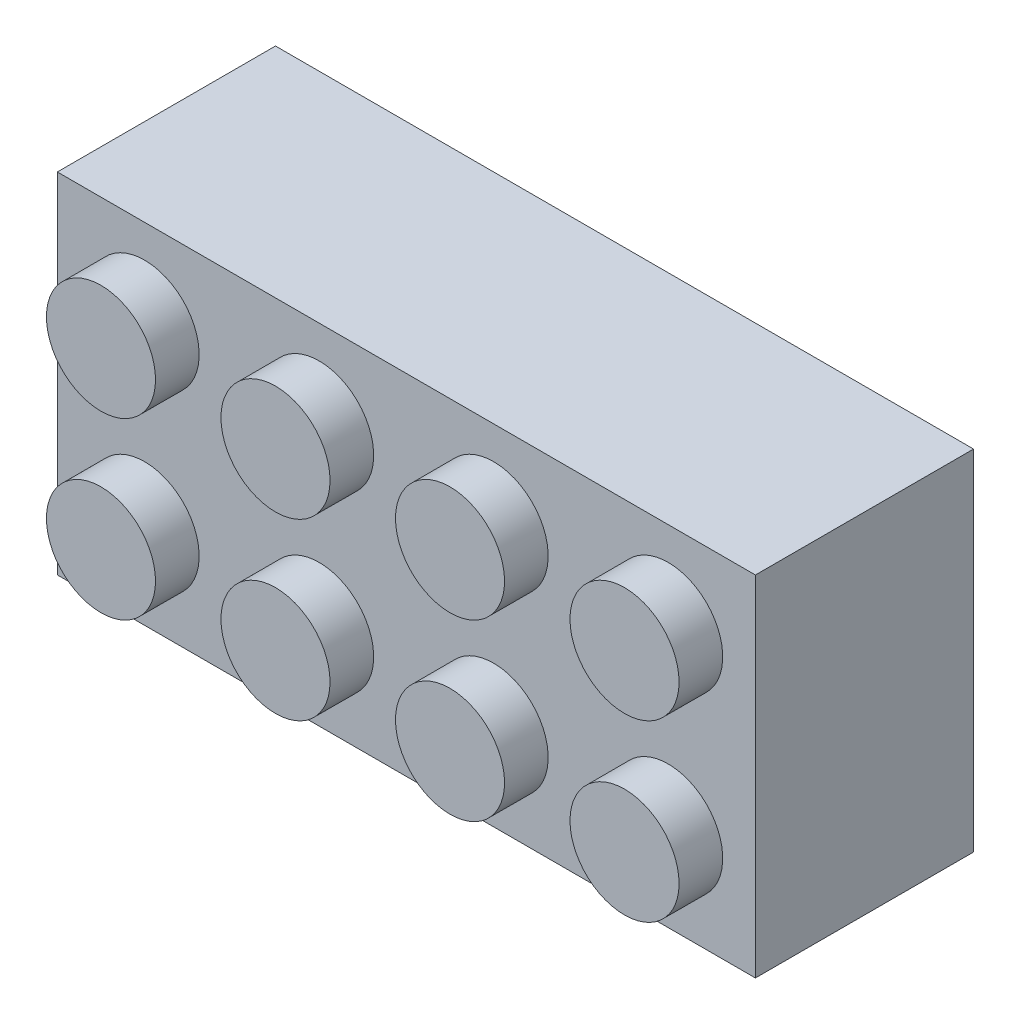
ISO-10303-21;
HEADER;
FILE_DESCRIPTION(('STEP AP214'),'2;1');
FILE_NAME('part.step','',(''),(''),'','','');
FILE_SCHEMA(('AUTOMOTIVE_DESIGN { 1 0 10303 214 1 1 1 1 }'));
ENDSEC;
DATA;
#1=APPLICATION_CONTEXT('core data for automotive mechanical design processes');
#2=APPLICATION_PROTOCOL_DEFINITION('international standard','automotive_design',2000,#1);
#3=PRODUCT_CONTEXT('',#1,'mechanical');
#4=PRODUCT('Part','Part','',(#3));
#5=PRODUCT_RELATED_PRODUCT_CATEGORY('part','',(#4));
#6=PRODUCT_DEFINITION_FORMATION('','',#4);
#7=PRODUCT_DEFINITION_CONTEXT('part definition',#1,'design');
#8=PRODUCT_DEFINITION('design','',#6,#7);
#9=PRODUCT_DEFINITION_SHAPE('','',#8);
#10=(LENGTH_UNIT() NAMED_UNIT(*) SI_UNIT(.MILLI.,.METRE.));
#11=(NAMED_UNIT(*) PLANE_ANGLE_UNIT() SI_UNIT($,.RADIAN.));
#12=(NAMED_UNIT(*) SI_UNIT($,.STERADIAN.) SOLID_ANGLE_UNIT());
#13=UNCERTAINTY_MEASURE_WITH_UNIT(LENGTH_MEASURE(1.E-05),#10,'distance_accuracy_value','');
#14=(GEOMETRIC_REPRESENTATION_CONTEXT(3) GLOBAL_UNCERTAINTY_ASSIGNED_CONTEXT((#13)) GLOBAL_UNIT_ASSIGNED_CONTEXT((#10,
#11,#12)) REPRESENTATION_CONTEXT('',''));
#15=CARTESIAN_POINT('',(0.,0.,0.));
#16=DIRECTION('',(0.,0.,1.));
#17=DIRECTION('',(1.,0.,0.));
#18=AXIS2_PLACEMENT_3D('',#15,#16,#17);
#19=CARTESIAN_POINT('',(0.,16.,9.));
#20=DIRECTION('',(0.,0.,-1.));
#21=DIRECTION('',(-1.,0.,0.));
#22=AXIS2_PLACEMENT_3D('',#19,#20,#21);
#23=PLANE('',#22);
#24=CARTESIAN_POINT('',(4.,12.,9.));
#25=DIRECTION('',(0.,0.,-1.));
#26=DIRECTION('',(-1.,0.,0.));
#27=AXIS2_PLACEMENT_3D('',#24,#25,#26);
#28=CIRCLE('',#27,1.5);
#29=CARTESIAN_POINT('',(2.5,12.,9.));
#30=VERTEX_POINT('',#29);
#31=EDGE_CURVE('E135',#30,#30,#28,.F.);
#32=ORIENTED_EDGE('',*,*,#31,.T.);
#33=EDGE_LOOP('',(#32));
#34=FACE_BOUND('',#33,.T.);
#35=DIRECTION('',(0.,-1.,0.));
#36=VECTOR('',#35,1.);
#37=CARTESIAN_POINT('',(1.,16.,9.));
#38=LINE('',#37,#36);
#39=CARTESIAN_POINT('',(1.,15.,9.));
#40=VERTEX_POINT('',#39);
#41=CARTESIAN_POINT('',(1.,1.,9.));
#42=VERTEX_POINT('',#41);
#43=EDGE_CURVE('E117',#40,#42,#38,.T.);
#44=ORIENTED_EDGE('',*,*,#43,.F.);
#45=DIRECTION('',(-1.,0.,0.));
#46=VECTOR('',#45,1.);
#47=CARTESIAN_POINT('',(0.,15.,9.));
#48=LINE('',#47,#46);
#49=CARTESIAN_POINT('',(31.,15.,9.));
#50=VERTEX_POINT('',#49);
#51=EDGE_CURVE('E125',#50,#40,#48,.T.);
#52=ORIENTED_EDGE('',*,*,#51,.F.);
#53=DIRECTION('',(0.,1.,0.));
#54=VECTOR('',#53,1.);
#55=CARTESIAN_POINT('',(31.,16.,9.));
#56=LINE('',#55,#54);
#57=CARTESIAN_POINT('',(31.,1.,9.));
#58=VERTEX_POINT('',#57);
#59=EDGE_CURVE('E116',#58,#50,#56,.T.);
#60=ORIENTED_EDGE('',*,*,#59,.F.);
#61=DIRECTION('',(1.,0.,0.));
#62=VECTOR('',#61,1.);
#63=CARTESIAN_POINT('',(0.,1.,9.));
#64=LINE('',#63,#62);
#65=EDGE_CURVE('E106',#42,#58,#64,.T.);
#66=ORIENTED_EDGE('',*,*,#65,.F.);
#67=EDGE_LOOP('',(#44,#52,#60,#66));
#68=FACE_BOUND('',#67,.T.);
#69=CARTESIAN_POINT('',(12.,12.,9.));
#70=DIRECTION('',(0.,0.,-1.));
#71=DIRECTION('',(-1.,0.,0.));
#72=AXIS2_PLACEMENT_3D('',#69,#70,#71);
#73=CIRCLE('',#72,1.5);
#74=CARTESIAN_POINT('',(10.5,12.,9.));
#75=VERTEX_POINT('',#74);
#76=EDGE_CURVE('E131',#75,#75,#73,.F.);
#77=ORIENTED_EDGE('',*,*,#76,.T.);
#78=EDGE_LOOP('',(#77));
#79=FACE_BOUND('',#78,.T.);
#80=CARTESIAN_POINT('',(20.,12.,9.));
#81=DIRECTION('',(0.,0.,-1.));
#82=DIRECTION('',(-1.,0.,0.));
#83=AXIS2_PLACEMENT_3D('',#80,#81,#82);
#84=CIRCLE('',#83,1.5);
#85=CARTESIAN_POINT('',(18.5,12.,9.));
#86=VERTEX_POINT('',#85);
#87=EDGE_CURVE('E134',#86,#86,#84,.F.);
#88=ORIENTED_EDGE('',*,*,#87,.T.);
#89=EDGE_LOOP('',(#88));
#90=FACE_BOUND('',#89,.T.);
#91=CARTESIAN_POINT('',(28.,12.,9.));
#92=DIRECTION('',(0.,0.,-1.));
#93=DIRECTION('',(-1.,0.,0.));
#94=AXIS2_PLACEMENT_3D('',#91,#92,#93);
#95=CIRCLE('',#94,1.5);
#96=CARTESIAN_POINT('',(26.5,12.,9.));
#97=VERTEX_POINT('',#96);
#98=EDGE_CURVE('E139',#97,#97,#95,.F.);
#99=ORIENTED_EDGE('',*,*,#98,.T.);
#100=EDGE_LOOP('',(#99));
#101=FACE_BOUND('',#100,.T.);
#102=CARTESIAN_POINT('',(4.,4.,9.));
#103=DIRECTION('',(0.,0.,-1.));
#104=DIRECTION('',(-1.,0.,0.));
#105=AXIS2_PLACEMENT_3D('',#102,#103,#104);
#106=CIRCLE('',#105,1.5);
#107=CARTESIAN_POINT('',(2.5,4.,9.));
#108=VERTEX_POINT('',#107);
#109=EDGE_CURVE('E143',#108,#108,#106,.F.);
#110=ORIENTED_EDGE('',*,*,#109,.T.);
#111=EDGE_LOOP('',(#110));
#112=FACE_BOUND('',#111,.T.);
#113=CARTESIAN_POINT('',(12.,4.,9.));
#114=DIRECTION('',(0.,0.,-1.));
#115=DIRECTION('',(-1.,0.,0.));
#116=AXIS2_PLACEMENT_3D('',#113,#114,#115);
#117=CIRCLE('',#116,1.5);
#118=CARTESIAN_POINT('',(10.5,4.,9.));
#119=VERTEX_POINT('',#118);
#120=EDGE_CURVE('E147',#119,#119,#117,.F.);
#121=ORIENTED_EDGE('',*,*,#120,.T.);
#122=EDGE_LOOP('',(#121));
#123=FACE_BOUND('',#122,.T.);
#124=CARTESIAN_POINT('',(20.,4.,9.));
#125=DIRECTION('',(0.,0.,-1.));
#126=DIRECTION('',(-1.,0.,0.));
#127=AXIS2_PLACEMENT_3D('',#124,#125,#126);
#128=CIRCLE('',#127,1.5);
#129=CARTESIAN_POINT('',(18.5,4.,9.));
#130=VERTEX_POINT('',#129);
#131=EDGE_CURVE('E151',#130,#130,#128,.F.);
#132=ORIENTED_EDGE('',*,*,#131,.T.);
#133=EDGE_LOOP('',(#132));
#134=FACE_BOUND('',#133,.T.);
#135=CARTESIAN_POINT('',(28.,4.,9.));
#136=DIRECTION('',(0.,0.,-1.));
#137=DIRECTION('',(-1.,0.,0.));
#138=AXIS2_PLACEMENT_3D('',#135,#136,#137);
#139=CIRCLE('',#138,1.5);
#140=CARTESIAN_POINT('',(26.5,4.,9.));
#141=VERTEX_POINT('',#140);
#142=EDGE_CURVE('E155',#141,#141,#139,.F.);
#143=ORIENTED_EDGE('',*,*,#142,.T.);
#144=EDGE_LOOP('',(#143));
#145=FACE_BOUND('',#144,.T.);
#146=CARTESIAN_POINT('',(8.,8.,9.));
#147=DIRECTION('',(0.,0.,-1.));
#148=DIRECTION('',(-1.,0.,0.));
#149=AXIS2_PLACEMENT_3D('',#146,#147,#148);
#150=CIRCLE('',#149,3.);
#151=CARTESIAN_POINT('',(5.,8.,9.));
#152=VERTEX_POINT('',#151);
#153=EDGE_CURVE('E307',#152,#152,#150,.T.);
#154=ORIENTED_EDGE('',*,*,#153,.F.);
#155=EDGE_LOOP('',(#154));
#156=FACE_BOUND('',#155,.T.);
#157=CARTESIAN_POINT('',(16.,8.,9.));
#158=DIRECTION('',(0.,0.,-1.));
#159=DIRECTION('',(-1.,0.,0.));
#160=AXIS2_PLACEMENT_3D('',#157,#158,#159);
#161=CIRCLE('',#160,3.);
#162=CARTESIAN_POINT('',(13.,8.,9.));
#163=VERTEX_POINT('',#162);
#164=EDGE_CURVE('E793',#163,#163,#161,.T.);
#165=ORIENTED_EDGE('',*,*,#164,.F.);
#166=EDGE_LOOP('',(#165));
#167=FACE_BOUND('',#166,.T.);
#168=CARTESIAN_POINT('',(24.,8.,9.));
#169=DIRECTION('',(0.,0.,-1.));
#170=DIRECTION('',(-1.,0.,0.));
#171=AXIS2_PLACEMENT_3D('',#168,#169,#170);
#172=CIRCLE('',#171,3.);
#173=CARTESIAN_POINT('',(21.,8.,9.));
#174=VERTEX_POINT('',#173);
#175=EDGE_CURVE('E782',#174,#174,#172,.T.);
#176=ORIENTED_EDGE('',*,*,#175,.F.);
#177=EDGE_LOOP('',(#176));
#178=FACE_BOUND('',#177,.T.);
#179=ADVANCED_FACE('F31',(#34,#68,#79,#90,#101,#112,#123,#134,#145,#156,#167,#178),#23,.T.);
#180=CARTESIAN_POINT('',(0.,16.,0.));
#181=DIRECTION('',(0.,0.,-1.));
#182=DIRECTION('',(-1.,0.,0.));
#183=AXIS2_PLACEMENT_3D('',#180,#181,#182);
#184=PLANE('',#183);
#185=DIRECTION('',(0.,-1.,0.));
#186=VECTOR('',#185,1.);
#187=CARTESIAN_POINT('',(0.,0.,0.));
#188=LINE('',#187,#186);
#189=CARTESIAN_POINT('',(0.,16.,0.));
#190=VERTEX_POINT('',#189);
#191=CARTESIAN_POINT('',(0.,0.,0.));
#192=VERTEX_POINT('',#191);
#193=EDGE_CURVE('E196',#190,#192,#188,.T.);
#194=ORIENTED_EDGE('',*,*,#193,.F.);
#195=DIRECTION('',(-1.,0.,0.));
#196=VECTOR('',#195,1.);
#197=CARTESIAN_POINT('',(0.,16.,0.));
#198=LINE('',#197,#196);
#199=CARTESIAN_POINT('',(32.,16.,0.));
#200=VERTEX_POINT('',#199);
#201=EDGE_CURVE('E76',#200,#190,#198,.T.);
#202=ORIENTED_EDGE('',*,*,#201,.F.);
#203=DIRECTION('',(0.,1.,0.));
#204=VECTOR('',#203,1.);
#205=CARTESIAN_POINT('',(32.,0.,0.));
#206=LINE('',#205,#204);
#207=CARTESIAN_POINT('',(32.,0.,0.));
#208=VERTEX_POINT('',#207);
#209=EDGE_CURVE('E208',#208,#200,#206,.T.);
#210=ORIENTED_EDGE('',*,*,#209,.F.);
#211=DIRECTION('',(1.,0.,0.));
#212=VECTOR('',#211,1.);
#213=CARTESIAN_POINT('',(0.,0.,0.));
#214=LINE('',#213,#212);
#215=EDGE_CURVE('E206',#192,#208,#214,.T.);
#216=ORIENTED_EDGE('',*,*,#215,.F.);
#217=EDGE_LOOP('',(#194,#202,#210,#216));
#218=FACE_BOUND('',#217,.T.);
#219=DIRECTION('',(-1.,0.,0.));
#220=VECTOR('',#219,1.);
#221=CARTESIAN_POINT('',(0.,15.,0.));
#222=LINE('',#221,#220);
#223=CARTESIAN_POINT('',(31.,15.,0.));
#224=VERTEX_POINT('',#223);
#225=CARTESIAN_POINT('',(1.,15.,0.));
#226=VERTEX_POINT('',#225);
#227=EDGE_CURVE('E186',#224,#226,#222,.T.);
#228=ORIENTED_EDGE('',*,*,#227,.T.);
#229=DIRECTION('',(0.,-1.,0.));
#230=VECTOR('',#229,1.);
#231=CARTESIAN_POINT('',(1.,16.,0.));
#232=LINE('',#231,#230);
#233=CARTESIAN_POINT('',(1.,1.,0.));
#234=VERTEX_POINT('',#233);
#235=EDGE_CURVE('E165',#226,#234,#232,.T.);
#236=ORIENTED_EDGE('',*,*,#235,.T.);
#237=DIRECTION('',(1.,0.,0.));
#238=VECTOR('',#237,1.);
#239=CARTESIAN_POINT('',(0.,1.,0.));
#240=LINE('',#239,#238);
#241=CARTESIAN_POINT('',(31.,1.,0.));
#242=VERTEX_POINT('',#241);
#243=EDGE_CURVE('E185',#234,#242,#240,.T.);
#244=ORIENTED_EDGE('',*,*,#243,.T.);
#245=DIRECTION('',(0.,1.,0.));
#246=VECTOR('',#245,1.);
#247=CARTESIAN_POINT('',(31.,16.,0.));
#248=LINE('',#247,#246);
#249=EDGE_CURVE('E46',#242,#224,#248,.T.);
#250=ORIENTED_EDGE('',*,*,#249,.T.);
#251=EDGE_LOOP('',(#228,#236,#244,#250));
#252=FACE_BOUND('',#251,.T.);
#253=ADVANCED_FACE('F294',(#218,#252),#184,.T.);
#254=CARTESIAN_POINT('',(0.,16.,10.));
#255=DIRECTION('',(0.,0.,-1.));
#256=DIRECTION('',(-1.,0.,0.));
#257=AXIS2_PLACEMENT_3D('',#254,#255,#256);
#258=PLANE('',#257);
#259=CARTESIAN_POINT('',(4.,12.,10.));
#260=DIRECTION('',(0.,0.,-1.));
#261=DIRECTION('',(-1.,0.,0.));
#262=AXIS2_PLACEMENT_3D('',#259,#260,#261);
#263=CIRCLE('',#262,2.5);
#264=CARTESIAN_POINT('',(1.5,12.,10.));
#265=VERTEX_POINT('',#264);
#266=EDGE_CURVE('E219',#265,#265,#263,.F.);
#267=ORIENTED_EDGE('',*,*,#266,.F.);
#268=EDGE_LOOP('',(#267));
#269=FACE_BOUND('',#268,.T.);
#270=DIRECTION('',(0.,-1.,0.));
#271=VECTOR('',#270,1.);
#272=CARTESIAN_POINT('',(0.,0.,10.));
#273=LINE('',#272,#271);
#274=CARTESIAN_POINT('',(0.,16.,10.));
#275=VERTEX_POINT('',#274);
#276=CARTESIAN_POINT('',(0.,0.,10.));
#277=VERTEX_POINT('',#276);
#278=EDGE_CURVE('E197',#275,#277,#273,.T.);
#279=ORIENTED_EDGE('',*,*,#278,.T.);
#280=DIRECTION('',(1.,0.,0.));
#281=VECTOR('',#280,1.);
#282=CARTESIAN_POINT('',(0.,0.,10.));
#283=LINE('',#282,#281);
#284=CARTESIAN_POINT('',(32.,0.,10.));
#285=VERTEX_POINT('',#284);
#286=EDGE_CURVE('E84',#277,#285,#283,.T.);
#287=ORIENTED_EDGE('',*,*,#286,.T.);
#288=DIRECTION('',(0.,1.,0.));
#289=VECTOR('',#288,1.);
#290=CARTESIAN_POINT('',(32.,0.,10.));
#291=LINE('',#290,#289);
#292=CARTESIAN_POINT('',(32.,16.,10.));
#293=VERTEX_POINT('',#292);
#294=EDGE_CURVE('E200',#285,#293,#291,.T.);
#295=ORIENTED_EDGE('',*,*,#294,.T.);
#296=DIRECTION('',(-1.,0.,0.));
#297=VECTOR('',#296,1.);
#298=CARTESIAN_POINT('',(0.,16.,10.));
#299=LINE('',#298,#297);
#300=EDGE_CURVE('E55',#293,#275,#299,.T.);
#301=ORIENTED_EDGE('',*,*,#300,.T.);
#302=EDGE_LOOP('',(#279,#287,#295,#301));
#303=FACE_BOUND('',#302,.T.);
#304=CARTESIAN_POINT('',(12.,12.,10.));
#305=DIRECTION('',(0.,0.,-1.));
#306=DIRECTION('',(-1.,0.,0.));
#307=AXIS2_PLACEMENT_3D('',#304,#305,#306);
#308=CIRCLE('',#307,2.5);
#309=CARTESIAN_POINT('',(9.5,12.,10.));
#310=VERTEX_POINT('',#309);
#311=EDGE_CURVE('E222',#310,#310,#308,.F.);
#312=ORIENTED_EDGE('',*,*,#311,.F.);
#313=EDGE_LOOP('',(#312));
#314=FACE_BOUND('',#313,.T.);
#315=CARTESIAN_POINT('',(20.,12.,10.));
#316=DIRECTION('',(0.,0.,-1.));
#317=DIRECTION('',(-1.,0.,0.));
#318=AXIS2_PLACEMENT_3D('',#315,#316,#317);
#319=CIRCLE('',#318,2.5);
#320=CARTESIAN_POINT('',(17.5,12.,10.));
#321=VERTEX_POINT('',#320);
#322=EDGE_CURVE('E225',#321,#321,#319,.F.);
#323=ORIENTED_EDGE('',*,*,#322,.F.);
#324=EDGE_LOOP('',(#323));
#325=FACE_BOUND('',#324,.T.);
#326=CARTESIAN_POINT('',(28.,12.,10.));
#327=DIRECTION('',(0.,0.,-1.));
#328=DIRECTION('',(-1.,0.,0.));
#329=AXIS2_PLACEMENT_3D('',#326,#327,#328);
#330=CIRCLE('',#329,2.5);
#331=CARTESIAN_POINT('',(25.5,12.,10.));
#332=VERTEX_POINT('',#331);
#333=EDGE_CURVE('E231',#332,#332,#330,.F.);
#334=ORIENTED_EDGE('',*,*,#333,.F.);
#335=EDGE_LOOP('',(#334));
#336=FACE_BOUND('',#335,.T.);
#337=CARTESIAN_POINT('',(4.,4.,10.));
#338=DIRECTION('',(0.,0.,-1.));
#339=DIRECTION('',(-1.,0.,0.));
#340=AXIS2_PLACEMENT_3D('',#337,#338,#339);
#341=CIRCLE('',#340,2.5);
#342=CARTESIAN_POINT('',(1.5,4.,10.));
#343=VERTEX_POINT('',#342);
#344=EDGE_CURVE('E237',#343,#343,#341,.F.);
#345=ORIENTED_EDGE('',*,*,#344,.F.);
#346=EDGE_LOOP('',(#345));
#347=FACE_BOUND('',#346,.T.);
#348=CARTESIAN_POINT('',(12.,4.,10.));
#349=DIRECTION('',(0.,0.,-1.));
#350=DIRECTION('',(-1.,0.,0.));
#351=AXIS2_PLACEMENT_3D('',#348,#349,#350);
#352=CIRCLE('',#351,2.5);
#353=CARTESIAN_POINT('',(9.5,4.,10.));
#354=VERTEX_POINT('',#353);
#355=EDGE_CURVE('E243',#354,#354,#352,.F.);
#356=ORIENTED_EDGE('',*,*,#355,.F.);
#357=EDGE_LOOP('',(#356));
#358=FACE_BOUND('',#357,.T.);
#359=CARTESIAN_POINT('',(20.,4.,10.));
#360=DIRECTION('',(0.,0.,-1.));
#361=DIRECTION('',(-1.,0.,0.));
#362=AXIS2_PLACEMENT_3D('',#359,#360,#361);
#363=CIRCLE('',#362,2.5);
#364=CARTESIAN_POINT('',(17.5,4.,10.));
#365=VERTEX_POINT('',#364);
#366=EDGE_CURVE('E249',#365,#365,#363,.F.);
#367=ORIENTED_EDGE('',*,*,#366,.F.);
#368=EDGE_LOOP('',(#367));
#369=FACE_BOUND('',#368,.T.);
#370=CARTESIAN_POINT('',(28.,4.,10.));
#371=DIRECTION('',(0.,0.,-1.));
#372=DIRECTION('',(-1.,0.,0.));
#373=AXIS2_PLACEMENT_3D('',#370,#371,#372);
#374=CIRCLE('',#373,2.5);
#375=CARTESIAN_POINT('',(25.5,4.,10.));
#376=VERTEX_POINT('',#375);
#377=EDGE_CURVE('E255',#376,#376,#374,.F.);
#378=ORIENTED_EDGE('',*,*,#377,.F.);
#379=EDGE_LOOP('',(#378));
#380=FACE_BOUND('',#379,.T.);
#381=ADVANCED_FACE('F299',(#269,#303,#314,#325,#336,#347,#358,#369,#380),#258,.F.);
#382=CARTESIAN_POINT('',(0.,0.,10.));
#383=DIRECTION('',(1.,0.,0.));
#384=DIRECTION('',(0.,0.,-1.));
#385=AXIS2_PLACEMENT_3D('',#382,#383,#384);
#386=PLANE('',#385);
#387=ORIENTED_EDGE('',*,*,#193,.T.);
#388=DIRECTION('',(0.,0.,-1.));
#389=VECTOR('',#388,1.);
#390=CARTESIAN_POINT('',(0.,0.,10.));
#391=LINE('',#390,#389);
#392=EDGE_CURVE('E217',#277,#192,#391,.T.);
#393=ORIENTED_EDGE('',*,*,#392,.F.);
#394=ORIENTED_EDGE('',*,*,#278,.F.);
#395=DIRECTION('',(0.,0.,-1.));
#396=VECTOR('',#395,1.);
#397=CARTESIAN_POINT('',(0.,16.,10.));
#398=LINE('',#397,#396);
#399=EDGE_CURVE('E203',#275,#190,#398,.T.);
#400=ORIENTED_EDGE('',*,*,#399,.T.);
#401=EDGE_LOOP('',(#387,#393,#394,#400));
#402=FACE_BOUND('',#401,.T.);
#403=ADVANCED_FACE('F409',(#402),#386,.F.);
#404=CARTESIAN_POINT('',(0.,0.,10.));
#405=DIRECTION('',(0.,1.,0.));
#406=DIRECTION('',(0.,0.,1.));
#407=AXIS2_PLACEMENT_3D('',#404,#405,#406);
#408=PLANE('',#407);
#409=ORIENTED_EDGE('',*,*,#215,.T.);
#410=DIRECTION('',(0.,0.,-1.));
#411=VECTOR('',#410,1.);
#412=CARTESIAN_POINT('',(32.,0.,10.));
#413=LINE('',#412,#411);
#414=EDGE_CURVE('E214',#285,#208,#413,.T.);
#415=ORIENTED_EDGE('',*,*,#414,.F.);
#416=ORIENTED_EDGE('',*,*,#286,.F.);
#417=ORIENTED_EDGE('',*,*,#392,.T.);
#418=EDGE_LOOP('',(#409,#415,#416,#417));
#419=FACE_BOUND('',#418,.T.);
#420=ADVANCED_FACE('F417',(#419),#408,.F.);
#421=CARTESIAN_POINT('',(32.,0.,10.));
#422=DIRECTION('',(-1.,0.,0.));
#423=DIRECTION('',(0.,0.,1.));
#424=AXIS2_PLACEMENT_3D('',#421,#422,#423);
#425=PLANE('',#424);
#426=ORIENTED_EDGE('',*,*,#209,.T.);
#427=DIRECTION('',(0.,0.,-1.));
#428=VECTOR('',#427,1.);
#429=CARTESIAN_POINT('',(32.,16.,10.));
#430=LINE('',#429,#428);
#431=EDGE_CURVE('E212',#293,#200,#430,.T.);
#432=ORIENTED_EDGE('',*,*,#431,.F.);
#433=ORIENTED_EDGE('',*,*,#294,.F.);
#434=ORIENTED_EDGE('',*,*,#414,.T.);
#435=EDGE_LOOP('',(#426,#432,#433,#434));
#436=FACE_BOUND('',#435,.T.);
#437=ADVANCED_FACE('F414',(#436),#425,.F.);
#438=CARTESIAN_POINT('',(0.,16.,10.));
#439=DIRECTION('',(0.,-1.,0.));
#440=DIRECTION('',(0.,0.,-1.));
#441=AXIS2_PLACEMENT_3D('',#438,#439,#440);
#442=PLANE('',#441);
#443=ORIENTED_EDGE('',*,*,#201,.T.);
#444=ORIENTED_EDGE('',*,*,#399,.F.);
#445=ORIENTED_EDGE('',*,*,#300,.F.);
#446=ORIENTED_EDGE('',*,*,#431,.T.);
#447=EDGE_LOOP('',(#443,#444,#445,#446));
#448=FACE_BOUND('',#447,.T.);
#449=ADVANCED_FACE('F406',(#448),#442,.F.);
#450=CARTESIAN_POINT('',(4.,12.,12.));
#451=DIRECTION('',(0.,0.,-1.));
#452=DIRECTION('',(-1.,0.,0.));
#453=AXIS2_PLACEMENT_3D('',#450,#451,#452);
#454=CYLINDRICAL_SURFACE('',#453,2.5);
#455=CARTESIAN_POINT('',(4.,12.,12.));
#456=DIRECTION('',(0.,0.,1.));
#457=DIRECTION('',(1.,0.,0.));
#458=AXIS2_PLACEMENT_3D('',#455,#456,#457);
#459=CIRCLE('',#458,2.5);
#460=CARTESIAN_POINT('',(6.5,12.,12.));
#461=VERTEX_POINT('',#460);
#462=EDGE_CURVE('E193',#461,#461,#459,.T.);
#463=ORIENTED_EDGE('',*,*,#462,.F.);
#464=EDGE_LOOP('',(#463));
#465=FACE_BOUND('',#464,.T.);
#466=ORIENTED_EDGE('',*,*,#266,.T.);
#467=EDGE_LOOP('',(#466));
#468=FACE_BOUND('',#467,.T.);
#469=ADVANCED_FACE('F402',(#465,#468),#454,.T.);
#470=CARTESIAN_POINT('',(4.,12.,12.));
#471=DIRECTION('',(0.,0.,1.));
#472=DIRECTION('',(1.,0.,0.));
#473=AXIS2_PLACEMENT_3D('',#470,#471,#472);
#474=PLANE('',#473);
#475=ORIENTED_EDGE('',*,*,#462,.T.);
#476=EDGE_LOOP('',(#475));
#477=FACE_BOUND('',#476,.T.);
#478=ADVANCED_FACE('F396',(#477),#474,.T.);
#479=CARTESIAN_POINT('',(12.,12.,12.));
#480=DIRECTION('',(0.,0.,-1.));
#481=DIRECTION('',(-1.,0.,0.));
#482=AXIS2_PLACEMENT_3D('',#479,#480,#481);
#483=CYLINDRICAL_SURFACE('',#482,2.5);
#484=CARTESIAN_POINT('',(12.,12.,12.));
#485=DIRECTION('',(0.,0.,1.));
#486=DIRECTION('',(1.,0.,0.));
#487=AXIS2_PLACEMENT_3D('',#484,#485,#486);
#488=CIRCLE('',#487,2.5);
#489=CARTESIAN_POINT('',(14.5,12.,12.));
#490=VERTEX_POINT('',#489);
#491=EDGE_CURVE('E182',#490,#490,#488,.T.);
#492=ORIENTED_EDGE('',*,*,#491,.F.);
#493=EDGE_LOOP('',(#492));
#494=FACE_BOUND('',#493,.T.);
#495=ORIENTED_EDGE('',*,*,#311,.T.);
#496=EDGE_LOOP('',(#495));
#497=FACE_BOUND('',#496,.T.);
#498=ADVANCED_FACE('F394',(#494,#497),#483,.T.);
#499=CARTESIAN_POINT('',(12.,12.,12.));
#500=DIRECTION('',(0.,0.,1.));
#501=DIRECTION('',(1.,0.,0.));
#502=AXIS2_PLACEMENT_3D('',#499,#500,#501);
#503=PLANE('',#502);
#504=ORIENTED_EDGE('',*,*,#491,.T.);
#505=EDGE_LOOP('',(#504));
#506=FACE_BOUND('',#505,.T.);
#507=ADVANCED_FACE('F390',(#506),#503,.T.);
#508=CARTESIAN_POINT('',(20.,12.,12.));
#509=DIRECTION('',(0.,0.,1.));
#510=DIRECTION('',(1.,0.,0.));
#511=AXIS2_PLACEMENT_3D('',#508,#509,#510);
#512=PLANE('',#511);
#513=CARTESIAN_POINT('',(20.,12.,12.));
#514=DIRECTION('',(0.,0.,1.));
#515=DIRECTION('',(1.,0.,0.));
#516=AXIS2_PLACEMENT_3D('',#513,#514,#515);
#517=CIRCLE('',#516,2.5);
#518=CARTESIAN_POINT('',(22.5,12.,12.));
#519=VERTEX_POINT('',#518);
#520=EDGE_CURVE('E228',#519,#519,#517,.T.);
#521=ORIENTED_EDGE('',*,*,#520,.T.);
#522=EDGE_LOOP('',(#521));
#523=FACE_BOUND('',#522,.T.);
#524=ADVANCED_FACE('F393',(#523),#512,.T.);
#525=CARTESIAN_POINT('',(20.,12.,12.));
#526=DIRECTION('',(0.,0.,-1.));
#527=DIRECTION('',(-1.,0.,0.));
#528=AXIS2_PLACEMENT_3D('',#525,#526,#527);
#529=CYLINDRICAL_SURFACE('',#528,2.5);
#530=ORIENTED_EDGE('',*,*,#520,.F.);
#531=EDGE_LOOP('',(#530));
#532=FACE_BOUND('',#531,.T.);
#533=ORIENTED_EDGE('',*,*,#322,.T.);
#534=EDGE_LOOP('',(#533));
#535=FACE_BOUND('',#534,.T.);
#536=ADVANCED_FACE('F424',(#532,#535),#529,.T.);
#537=CARTESIAN_POINT('',(28.,12.,12.));
#538=DIRECTION('',(0.,0.,1.));
#539=DIRECTION('',(1.,0.,0.));
#540=AXIS2_PLACEMENT_3D('',#537,#538,#539);
#541=PLANE('',#540);
#542=CARTESIAN_POINT('',(28.,12.,12.));
#543=DIRECTION('',(0.,0.,1.));
#544=DIRECTION('',(1.,0.,0.));
#545=AXIS2_PLACEMENT_3D('',#542,#543,#544);
#546=CIRCLE('',#545,2.5);
#547=CARTESIAN_POINT('',(30.5,12.,12.));
#548=VERTEX_POINT('',#547);
#549=EDGE_CURVE('E234',#548,#548,#546,.T.);
#550=ORIENTED_EDGE('',*,*,#549,.T.);
#551=EDGE_LOOP('',(#550));
#552=FACE_BOUND('',#551,.T.);
#553=ADVANCED_FACE('F427',(#552),#541,.T.);
#554=CARTESIAN_POINT('',(28.,12.,12.));
#555=DIRECTION('',(0.,0.,-1.));
#556=DIRECTION('',(-1.,0.,0.));
#557=AXIS2_PLACEMENT_3D('',#554,#555,#556);
#558=CYLINDRICAL_SURFACE('',#557,2.5);
#559=ORIENTED_EDGE('',*,*,#549,.F.);
#560=EDGE_LOOP('',(#559));
#561=FACE_BOUND('',#560,.T.);
#562=ORIENTED_EDGE('',*,*,#333,.T.);
#563=EDGE_LOOP('',(#562));
#564=FACE_BOUND('',#563,.T.);
#565=ADVANCED_FACE('F432',(#561,#564),#558,.T.);
#566=CARTESIAN_POINT('',(4.,4.,12.));
#567=DIRECTION('',(0.,0.,1.));
#568=DIRECTION('',(1.,0.,0.));
#569=AXIS2_PLACEMENT_3D('',#566,#567,#568);
#570=PLANE('',#569);
#571=CARTESIAN_POINT('',(4.,4.,12.));
#572=DIRECTION('',(0.,0.,1.));
#573=DIRECTION('',(1.,0.,0.));
#574=AXIS2_PLACEMENT_3D('',#571,#572,#573);
#575=CIRCLE('',#574,2.5);
#576=CARTESIAN_POINT('',(6.5,4.,12.));
#577=VERTEX_POINT('',#576);
#578=EDGE_CURVE('E240',#577,#577,#575,.T.);
#579=ORIENTED_EDGE('',*,*,#578,.T.);
#580=EDGE_LOOP('',(#579));
#581=FACE_BOUND('',#580,.T.);
#582=ADVANCED_FACE('F435',(#581),#570,.T.);
#583=CARTESIAN_POINT('',(4.,4.,12.));
#584=DIRECTION('',(0.,0.,-1.));
#585=DIRECTION('',(-1.,0.,0.));
#586=AXIS2_PLACEMENT_3D('',#583,#584,#585);
#587=CYLINDRICAL_SURFACE('',#586,2.5);
#588=ORIENTED_EDGE('',*,*,#578,.F.);
#589=EDGE_LOOP('',(#588));
#590=FACE_BOUND('',#589,.T.);
#591=ORIENTED_EDGE('',*,*,#344,.T.);
#592=EDGE_LOOP('',(#591));
#593=FACE_BOUND('',#592,.T.);
#594=ADVANCED_FACE('F440',(#590,#593),#587,.T.);
#595=CARTESIAN_POINT('',(12.,4.,12.));
#596=DIRECTION('',(0.,0.,1.));
#597=DIRECTION('',(1.,0.,0.));
#598=AXIS2_PLACEMENT_3D('',#595,#596,#597);
#599=PLANE('',#598);
#600=CARTESIAN_POINT('',(12.,4.,12.));
#601=DIRECTION('',(0.,0.,1.));
#602=DIRECTION('',(1.,0.,0.));
#603=AXIS2_PLACEMENT_3D('',#600,#601,#602);
#604=CIRCLE('',#603,2.5);
#605=CARTESIAN_POINT('',(14.5,4.,12.));
#606=VERTEX_POINT('',#605);
#607=EDGE_CURVE('E246',#606,#606,#604,.T.);
#608=ORIENTED_EDGE('',*,*,#607,.T.);
#609=EDGE_LOOP('',(#608));
#610=FACE_BOUND('',#609,.T.);
#611=ADVANCED_FACE('F443',(#610),#599,.T.);
#612=CARTESIAN_POINT('',(12.,4.,12.));
#613=DIRECTION('',(0.,0.,-1.));
#614=DIRECTION('',(-1.,0.,0.));
#615=AXIS2_PLACEMENT_3D('',#612,#613,#614);
#616=CYLINDRICAL_SURFACE('',#615,2.5);
#617=ORIENTED_EDGE('',*,*,#607,.F.);
#618=EDGE_LOOP('',(#617));
#619=FACE_BOUND('',#618,.T.);
#620=ORIENTED_EDGE('',*,*,#355,.T.);
#621=EDGE_LOOP('',(#620));
#622=FACE_BOUND('',#621,.T.);
#623=ADVANCED_FACE('F448',(#619,#622),#616,.T.);
#624=CARTESIAN_POINT('',(20.,4.,12.));
#625=DIRECTION('',(0.,0.,1.));
#626=DIRECTION('',(1.,0.,0.));
#627=AXIS2_PLACEMENT_3D('',#624,#625,#626);
#628=PLANE('',#627);
#629=CARTESIAN_POINT('',(20.,4.,12.));
#630=DIRECTION('',(0.,0.,1.));
#631=DIRECTION('',(1.,0.,0.));
#632=AXIS2_PLACEMENT_3D('',#629,#630,#631);
#633=CIRCLE('',#632,2.5);
#634=CARTESIAN_POINT('',(22.5,4.,12.));
#635=VERTEX_POINT('',#634);
#636=EDGE_CURVE('E252',#635,#635,#633,.T.);
#637=ORIENTED_EDGE('',*,*,#636,.T.);
#638=EDGE_LOOP('',(#637));
#639=FACE_BOUND('',#638,.T.);
#640=ADVANCED_FACE('F451',(#639),#628,.T.);
#641=CARTESIAN_POINT('',(20.,4.,12.));
#642=DIRECTION('',(0.,0.,-1.));
#643=DIRECTION('',(-1.,0.,0.));
#644=AXIS2_PLACEMENT_3D('',#641,#642,#643);
#645=CYLINDRICAL_SURFACE('',#644,2.5);
#646=ORIENTED_EDGE('',*,*,#636,.F.);
#647=EDGE_LOOP('',(#646));
#648=FACE_BOUND('',#647,.T.);
#649=ORIENTED_EDGE('',*,*,#366,.T.);
#650=EDGE_LOOP('',(#649));
#651=FACE_BOUND('',#650,.T.);
#652=ADVANCED_FACE('F456',(#648,#651),#645,.T.);
#653=CARTESIAN_POINT('',(28.,4.,12.));
#654=DIRECTION('',(0.,0.,1.));
#655=DIRECTION('',(1.,0.,0.));
#656=AXIS2_PLACEMENT_3D('',#653,#654,#655);
#657=PLANE('',#656);
#658=CARTESIAN_POINT('',(28.,4.,12.));
#659=DIRECTION('',(0.,0.,1.));
#660=DIRECTION('',(1.,0.,0.));
#661=AXIS2_PLACEMENT_3D('',#658,#659,#660);
#662=CIRCLE('',#661,2.5);
#663=CARTESIAN_POINT('',(30.5,4.,12.));
#664=VERTEX_POINT('',#663);
#665=EDGE_CURVE('E258',#664,#664,#662,.T.);
#666=ORIENTED_EDGE('',*,*,#665,.T.);
#667=EDGE_LOOP('',(#666));
#668=FACE_BOUND('',#667,.T.);
#669=ADVANCED_FACE('F33',(#668),#657,.T.);
#670=CARTESIAN_POINT('',(28.,4.,12.));
#671=DIRECTION('',(0.,0.,-1.));
#672=DIRECTION('',(-1.,0.,0.));
#673=AXIS2_PLACEMENT_3D('',#670,#671,#672);
#674=CYLINDRICAL_SURFACE('',#673,2.5);
#675=ORIENTED_EDGE('',*,*,#665,.F.);
#676=EDGE_LOOP('',(#675));
#677=FACE_BOUND('',#676,.T.);
#678=ORIENTED_EDGE('',*,*,#377,.T.);
#679=EDGE_LOOP('',(#678));
#680=FACE_BOUND('',#679,.T.);
#681=ADVANCED_FACE('F462',(#677,#680),#674,.T.);
#682=CARTESIAN_POINT('',(1.,0.,10.));
#683=DIRECTION('',(1.,0.,0.));
#684=DIRECTION('',(0.,0.,-1.));
#685=AXIS2_PLACEMENT_3D('',#682,#683,#684);
#686=PLANE('',#685);
#687=ORIENTED_EDGE('',*,*,#235,.F.);
#688=DIRECTION('',(0.,0.,-1.));
#689=VECTOR('',#688,1.);
#690=CARTESIAN_POINT('',(1.,15.,10.));
#691=LINE('',#690,#689);
#692=EDGE_CURVE('E127',#40,#226,#691,.T.);
#693=ORIENTED_EDGE('',*,*,#692,.F.);
#694=ORIENTED_EDGE('',*,*,#43,.T.);
#695=DIRECTION('',(0.,0.,-1.));
#696=VECTOR('',#695,1.);
#697=CARTESIAN_POINT('',(1.,1.,10.));
#698=LINE('',#697,#696);
#699=EDGE_CURVE('E111',#42,#234,#698,.T.);
#700=ORIENTED_EDGE('',*,*,#699,.T.);
#701=EDGE_LOOP('',(#687,#693,#694,#700));
#702=FACE_BOUND('',#701,.T.);
#703=ADVANCED_FACE('F312',(#702),#686,.T.);
#704=CARTESIAN_POINT('',(0.,1.,10.));
#705=DIRECTION('',(0.,1.,0.));
#706=DIRECTION('',(0.,0.,1.));
#707=AXIS2_PLACEMENT_3D('',#704,#705,#706);
#708=PLANE('',#707);
#709=ORIENTED_EDGE('',*,*,#243,.F.);
#710=ORIENTED_EDGE('',*,*,#699,.F.);
#711=ORIENTED_EDGE('',*,*,#65,.T.);
#712=DIRECTION('',(0.,0.,-1.));
#713=VECTOR('',#712,1.);
#714=CARTESIAN_POINT('',(31.,1.,10.));
#715=LINE('',#714,#713);
#716=EDGE_CURVE('E108',#58,#242,#715,.T.);
#717=ORIENTED_EDGE('',*,*,#716,.T.);
#718=EDGE_LOOP('',(#709,#710,#711,#717));
#719=FACE_BOUND('',#718,.T.);
#720=ADVANCED_FACE('F107',(#719),#708,.T.);
#721=CARTESIAN_POINT('',(31.,0.,10.));
#722=DIRECTION('',(-1.,0.,0.));
#723=DIRECTION('',(0.,0.,1.));
#724=AXIS2_PLACEMENT_3D('',#721,#722,#723);
#725=PLANE('',#724);
#726=ORIENTED_EDGE('',*,*,#249,.F.);
#727=ORIENTED_EDGE('',*,*,#716,.F.);
#728=ORIENTED_EDGE('',*,*,#59,.T.);
#729=DIRECTION('',(0.,0.,-1.));
#730=VECTOR('',#729,1.);
#731=CARTESIAN_POINT('',(31.,15.,10.));
#732=LINE('',#731,#730);
#733=EDGE_CURVE('E121',#50,#224,#732,.T.);
#734=ORIENTED_EDGE('',*,*,#733,.T.);
#735=EDGE_LOOP('',(#726,#727,#728,#734));
#736=FACE_BOUND('',#735,.T.);
#737=ADVANCED_FACE('F119',(#736),#725,.T.);
#738=CARTESIAN_POINT('',(0.,15.,10.));
#739=DIRECTION('',(0.,-1.,0.));
#740=DIRECTION('',(0.,0.,-1.));
#741=AXIS2_PLACEMENT_3D('',#738,#739,#740);
#742=PLANE('',#741);
#743=ORIENTED_EDGE('',*,*,#227,.F.);
#744=ORIENTED_EDGE('',*,*,#733,.F.);
#745=ORIENTED_EDGE('',*,*,#51,.T.);
#746=ORIENTED_EDGE('',*,*,#692,.T.);
#747=EDGE_LOOP('',(#743,#744,#745,#746));
#748=FACE_BOUND('',#747,.T.);
#749=ADVANCED_FACE('F315',(#748),#742,.T.);
#750=CARTESIAN_POINT('',(4.,12.,12.));
#751=DIRECTION('',(0.,0.,-1.));
#752=DIRECTION('',(-1.,0.,0.));
#753=AXIS2_PLACEMENT_3D('',#750,#751,#752);
#754=CYLINDRICAL_SURFACE('',#753,1.5);
#755=CARTESIAN_POINT('',(4.,12.,11.));
#756=DIRECTION('',(0.,0.,1.));
#757=DIRECTION('',(1.,0.,0.));
#758=AXIS2_PLACEMENT_3D('',#755,#756,#757);
#759=CIRCLE('',#758,1.5);
#760=CARTESIAN_POINT('',(5.5,12.,11.));
#761=VERTEX_POINT('',#760);
#762=EDGE_CURVE('E162',#761,#761,#759,.T.);
#763=ORIENTED_EDGE('',*,*,#762,.T.);
#764=EDGE_LOOP('',(#763));
#765=FACE_BOUND('',#764,.T.);
#766=ORIENTED_EDGE('',*,*,#31,.F.);
#767=EDGE_LOOP('',(#766));
#768=FACE_BOUND('',#767,.T.);
#769=ADVANCED_FACE('F318',(#765,#768),#754,.F.);
#770=CARTESIAN_POINT('',(4.,12.,11.));
#771=DIRECTION('',(0.,0.,1.));
#772=DIRECTION('',(1.,0.,0.));
#773=AXIS2_PLACEMENT_3D('',#770,#771,#772);
#774=PLANE('',#773);
#775=ORIENTED_EDGE('',*,*,#762,.F.);
#776=EDGE_LOOP('',(#775));
#777=FACE_BOUND('',#776,.T.);
#778=ADVANCED_FACE('F324',(#777),#774,.F.);
#779=CARTESIAN_POINT('',(12.,12.,12.));
#780=DIRECTION('',(0.,0.,-1.));
#781=DIRECTION('',(-1.,0.,0.));
#782=AXIS2_PLACEMENT_3D('',#779,#780,#781);
#783=CYLINDRICAL_SURFACE('',#782,1.5);
#784=CARTESIAN_POINT('',(12.,12.,11.));
#785=DIRECTION('',(0.,0.,1.));
#786=DIRECTION('',(1.,0.,0.));
#787=AXIS2_PLACEMENT_3D('',#784,#785,#786);
#788=CIRCLE('',#787,1.5);
#789=CARTESIAN_POINT('',(13.5,12.,11.));
#790=VERTEX_POINT('',#789);
#791=EDGE_CURVE('E166',#790,#790,#788,.T.);
#792=ORIENTED_EDGE('',*,*,#791,.T.);
#793=EDGE_LOOP('',(#792));
#794=FACE_BOUND('',#793,.T.);
#795=ORIENTED_EDGE('',*,*,#76,.F.);
#796=EDGE_LOOP('',(#795));
#797=FACE_BOUND('',#796,.T.);
#798=ADVANCED_FACE('F332',(#794,#797),#783,.F.);
#799=CARTESIAN_POINT('',(12.,12.,11.));
#800=DIRECTION('',(0.,0.,1.));
#801=DIRECTION('',(1.,0.,0.));
#802=AXIS2_PLACEMENT_3D('',#799,#800,#801);
#803=PLANE('',#802);
#804=ORIENTED_EDGE('',*,*,#791,.F.);
#805=EDGE_LOOP('',(#804));
#806=FACE_BOUND('',#805,.T.);
#807=ADVANCED_FACE('F334',(#806),#803,.F.);
#808=CARTESIAN_POINT('',(20.,12.,11.));
#809=DIRECTION('',(0.,0.,1.));
#810=DIRECTION('',(1.,0.,0.));
#811=AXIS2_PLACEMENT_3D('',#808,#809,#810);
#812=PLANE('',#811);
#813=CARTESIAN_POINT('',(20.,12.,11.));
#814=DIRECTION('',(0.,0.,1.));
#815=DIRECTION('',(1.,0.,0.));
#816=AXIS2_PLACEMENT_3D('',#813,#814,#815);
#817=CIRCLE('',#816,1.5);
#818=CARTESIAN_POINT('',(21.5,12.,11.));
#819=VERTEX_POINT('',#818);
#820=EDGE_CURVE('E138',#819,#819,#817,.T.);
#821=ORIENTED_EDGE('',*,*,#820,.F.);
#822=EDGE_LOOP('',(#821));
#823=FACE_BOUND('',#822,.T.);
#824=ADVANCED_FACE('F338',(#823),#812,.F.);
#825=CARTESIAN_POINT('',(20.,12.,12.));
#826=DIRECTION('',(0.,0.,-1.));
#827=DIRECTION('',(-1.,0.,0.));
#828=AXIS2_PLACEMENT_3D('',#825,#826,#827);
#829=CYLINDRICAL_SURFACE('',#828,1.5);
#830=ORIENTED_EDGE('',*,*,#820,.T.);
#831=EDGE_LOOP('',(#830));
#832=FACE_BOUND('',#831,.T.);
#833=ORIENTED_EDGE('',*,*,#87,.F.);
#834=EDGE_LOOP('',(#833));
#835=FACE_BOUND('',#834,.T.);
#836=ADVANCED_FACE('F344',(#832,#835),#829,.F.);
#837=CARTESIAN_POINT('',(28.,12.,11.));
#838=DIRECTION('',(0.,0.,1.));
#839=DIRECTION('',(1.,0.,0.));
#840=AXIS2_PLACEMENT_3D('',#837,#838,#839);
#841=PLANE('',#840);
#842=CARTESIAN_POINT('',(28.,12.,11.));
#843=DIRECTION('',(0.,0.,1.));
#844=DIRECTION('',(1.,0.,0.));
#845=AXIS2_PLACEMENT_3D('',#842,#843,#844);
#846=CIRCLE('',#845,1.5);
#847=CARTESIAN_POINT('',(29.5,12.,11.));
#848=VERTEX_POINT('',#847);
#849=EDGE_CURVE('E142',#848,#848,#846,.T.);
#850=ORIENTED_EDGE('',*,*,#849,.F.);
#851=EDGE_LOOP('',(#850));
#852=FACE_BOUND('',#851,.T.);
#853=ADVANCED_FACE('F348',(#852),#841,.F.);
#854=CARTESIAN_POINT('',(28.,12.,12.));
#855=DIRECTION('',(0.,0.,-1.));
#856=DIRECTION('',(-1.,0.,0.));
#857=AXIS2_PLACEMENT_3D('',#854,#855,#856);
#858=CYLINDRICAL_SURFACE('',#857,1.5);
#859=ORIENTED_EDGE('',*,*,#849,.T.);
#860=EDGE_LOOP('',(#859));
#861=FACE_BOUND('',#860,.T.);
#862=ORIENTED_EDGE('',*,*,#98,.F.);
#863=EDGE_LOOP('',(#862));
#864=FACE_BOUND('',#863,.T.);
#865=ADVANCED_FACE('F352',(#861,#864),#858,.F.);
#866=CARTESIAN_POINT('',(4.,4.,11.));
#867=DIRECTION('',(0.,0.,1.));
#868=DIRECTION('',(1.,0.,0.));
#869=AXIS2_PLACEMENT_3D('',#866,#867,#868);
#870=PLANE('',#869);
#871=CARTESIAN_POINT('',(4.,4.,11.));
#872=DIRECTION('',(0.,0.,1.));
#873=DIRECTION('',(1.,0.,0.));
#874=AXIS2_PLACEMENT_3D('',#871,#872,#873);
#875=CIRCLE('',#874,1.5);
#876=CARTESIAN_POINT('',(5.5,4.,11.));
#877=VERTEX_POINT('',#876);
#878=EDGE_CURVE('E146',#877,#877,#875,.T.);
#879=ORIENTED_EDGE('',*,*,#878,.F.);
#880=EDGE_LOOP('',(#879));
#881=FACE_BOUND('',#880,.T.);
#882=ADVANCED_FACE('F356',(#881),#870,.F.);
#883=CARTESIAN_POINT('',(4.,4.,12.));
#884=DIRECTION('',(0.,0.,-1.));
#885=DIRECTION('',(-1.,0.,0.));
#886=AXIS2_PLACEMENT_3D('',#883,#884,#885);
#887=CYLINDRICAL_SURFACE('',#886,1.5);
#888=ORIENTED_EDGE('',*,*,#878,.T.);
#889=EDGE_LOOP('',(#888));
#890=FACE_BOUND('',#889,.T.);
#891=ORIENTED_EDGE('',*,*,#109,.F.);
#892=EDGE_LOOP('',(#891));
#893=FACE_BOUND('',#892,.T.);
#894=ADVANCED_FACE('F360',(#890,#893),#887,.F.);
#895=CARTESIAN_POINT('',(12.,4.,11.));
#896=DIRECTION('',(0.,0.,1.));
#897=DIRECTION('',(1.,0.,0.));
#898=AXIS2_PLACEMENT_3D('',#895,#896,#897);
#899=PLANE('',#898);
#900=CARTESIAN_POINT('',(12.,4.,11.));
#901=DIRECTION('',(0.,0.,1.));
#902=DIRECTION('',(1.,0.,0.));
#903=AXIS2_PLACEMENT_3D('',#900,#901,#902);
#904=CIRCLE('',#903,1.5);
#905=CARTESIAN_POINT('',(13.5,4.,11.));
#906=VERTEX_POINT('',#905);
#907=EDGE_CURVE('E150',#906,#906,#904,.T.);
#908=ORIENTED_EDGE('',*,*,#907,.F.);
#909=EDGE_LOOP('',(#908));
#910=FACE_BOUND('',#909,.T.);
#911=ADVANCED_FACE('F364',(#910),#899,.F.);
#912=CARTESIAN_POINT('',(12.,4.,12.));
#913=DIRECTION('',(0.,0.,-1.));
#914=DIRECTION('',(-1.,0.,0.));
#915=AXIS2_PLACEMENT_3D('',#912,#913,#914);
#916=CYLINDRICAL_SURFACE('',#915,1.5);
#917=ORIENTED_EDGE('',*,*,#907,.T.);
#918=EDGE_LOOP('',(#917));
#919=FACE_BOUND('',#918,.T.);
#920=ORIENTED_EDGE('',*,*,#120,.F.);
#921=EDGE_LOOP('',(#920));
#922=FACE_BOUND('',#921,.T.);
#923=ADVANCED_FACE('F368',(#919,#922),#916,.F.);
#924=CARTESIAN_POINT('',(20.,4.,11.));
#925=DIRECTION('',(0.,0.,1.));
#926=DIRECTION('',(1.,0.,0.));
#927=AXIS2_PLACEMENT_3D('',#924,#925,#926);
#928=PLANE('',#927);
#929=CARTESIAN_POINT('',(20.,4.,11.));
#930=DIRECTION('',(0.,0.,1.));
#931=DIRECTION('',(1.,0.,0.));
#932=AXIS2_PLACEMENT_3D('',#929,#930,#931);
#933=CIRCLE('',#932,1.5);
#934=CARTESIAN_POINT('',(21.5,4.,11.));
#935=VERTEX_POINT('',#934);
#936=EDGE_CURVE('E154',#935,#935,#933,.T.);
#937=ORIENTED_EDGE('',*,*,#936,.F.);
#938=EDGE_LOOP('',(#937));
#939=FACE_BOUND('',#938,.T.);
#940=ADVANCED_FACE('F372',(#939),#928,.F.);
#941=CARTESIAN_POINT('',(20.,4.,12.));
#942=DIRECTION('',(0.,0.,-1.));
#943=DIRECTION('',(-1.,0.,0.));
#944=AXIS2_PLACEMENT_3D('',#941,#942,#943);
#945=CYLINDRICAL_SURFACE('',#944,1.5);
#946=ORIENTED_EDGE('',*,*,#936,.T.);
#947=EDGE_LOOP('',(#946));
#948=FACE_BOUND('',#947,.T.);
#949=ORIENTED_EDGE('',*,*,#131,.F.);
#950=EDGE_LOOP('',(#949));
#951=FACE_BOUND('',#950,.T.);
#952=ADVANCED_FACE('F376',(#948,#951),#945,.F.);
#953=CARTESIAN_POINT('',(28.,4.,11.));
#954=DIRECTION('',(0.,0.,1.));
#955=DIRECTION('',(1.,0.,0.));
#956=AXIS2_PLACEMENT_3D('',#953,#954,#955);
#957=PLANE('',#956);
#958=CARTESIAN_POINT('',(28.,4.,11.));
#959=DIRECTION('',(0.,0.,1.));
#960=DIRECTION('',(1.,0.,0.));
#961=AXIS2_PLACEMENT_3D('',#958,#959,#960);
#962=CIRCLE('',#961,1.5);
#963=CARTESIAN_POINT('',(29.5,4.,11.));
#964=VERTEX_POINT('',#963);
#965=EDGE_CURVE('E158',#964,#964,#962,.T.);
#966=ORIENTED_EDGE('',*,*,#965,.F.);
#967=EDGE_LOOP('',(#966));
#968=FACE_BOUND('',#967,.T.);
#969=ADVANCED_FACE('F380',(#968),#957,.F.);
#970=CARTESIAN_POINT('',(28.,4.,12.));
#971=DIRECTION('',(0.,0.,-1.));
#972=DIRECTION('',(-1.,0.,0.));
#973=AXIS2_PLACEMENT_3D('',#970,#971,#972);
#974=CYLINDRICAL_SURFACE('',#973,1.5);
#975=ORIENTED_EDGE('',*,*,#965,.T.);
#976=EDGE_LOOP('',(#975));
#977=FACE_BOUND('',#976,.T.);
#978=ORIENTED_EDGE('',*,*,#142,.F.);
#979=EDGE_LOOP('',(#978));
#980=FACE_BOUND('',#979,.T.);
#981=ADVANCED_FACE('F384',(#977,#980),#974,.F.);
#982=CARTESIAN_POINT('',(8.,8.,0.));
#983=DIRECTION('',(0.,0.,-1.));
#984=DIRECTION('',(-1.,0.,0.));
#985=AXIS2_PLACEMENT_3D('',#982,#983,#984);
#986=PLANE('',#985);
#987=CARTESIAN_POINT('',(8.,8.,0.));
#988=DIRECTION('',(0.,0.,-1.));
#989=DIRECTION('',(-1.,0.,0.));
#990=AXIS2_PLACEMENT_3D('',#987,#988,#989);
#991=CIRCLE('',#990,3.);
#992=CARTESIAN_POINT('',(5.,8.,0.));
#993=VERTEX_POINT('',#992);
#994=EDGE_CURVE('E169',#993,#993,#991,.T.);
#995=ORIENTED_EDGE('',*,*,#994,.T.);
#996=EDGE_LOOP('',(#995));
#997=FACE_BOUND('',#996,.T.);
#998=CARTESIAN_POINT('',(8.,8.,0.));
#999=DIRECTION('',(0.,0.,-1.));
#1000=DIRECTION('',(-1.,0.,0.));
#1001=AXIS2_PLACEMENT_3D('',#998,#999,#1000);
#1002=CIRCLE('',#1001,2.5);
#1003=CARTESIAN_POINT('',(5.5,8.,0.));
#1004=VERTEX_POINT('',#1003);
#1005=EDGE_CURVE('E797',#1004,#1004,#1002,.T.);
#1006=ORIENTED_EDGE('',*,*,#1005,.F.);
#1007=EDGE_LOOP('',(#1006));
#1008=FACE_BOUND('',#1007,.T.);
#1009=ADVANCED_FACE('F388',(#997,#1008),#986,.T.);
#1010=CARTESIAN_POINT('',(8.,8.,0.));
#1011=DIRECTION('',(0.,0.,1.));
#1012=DIRECTION('',(1.,0.,0.));
#1013=AXIS2_PLACEMENT_3D('',#1010,#1011,#1012);
#1014=CYLINDRICAL_SURFACE('',#1013,3.);
#1015=ORIENTED_EDGE('',*,*,#994,.F.);
#1016=EDGE_LOOP('',(#1015));
#1017=FACE_BOUND('',#1016,.T.);
#1018=ORIENTED_EDGE('',*,*,#153,.T.);
#1019=EDGE_LOOP('',(#1018));
#1020=FACE_BOUND('',#1019,.T.);
#1021=ADVANCED_FACE('F688',(#1017,#1020),#1014,.T.);
#1022=CARTESIAN_POINT('',(8.,8.,0.));
#1023=DIRECTION('',(0.,0.,1.));
#1024=DIRECTION('',(1.,0.,0.));
#1025=AXIS2_PLACEMENT_3D('',#1022,#1023,#1024);
#1026=CYLINDRICAL_SURFACE('',#1025,2.5);
#1027=ORIENTED_EDGE('',*,*,#1005,.T.);
#1028=EDGE_LOOP('',(#1027));
#1029=FACE_BOUND('',#1028,.T.);
#1030=CARTESIAN_POINT('',(8.,8.,9.));
#1031=DIRECTION('',(0.,0.,-1.));
#1032=DIRECTION('',(-1.,0.,0.));
#1033=AXIS2_PLACEMENT_3D('',#1030,#1031,#1032);
#1034=CIRCLE('',#1033,2.5);
#1035=CARTESIAN_POINT('',(5.5,8.,9.));
#1036=VERTEX_POINT('',#1035);
#1037=EDGE_CURVE('E261',#1036,#1036,#1034,.F.);
#1038=ORIENTED_EDGE('',*,*,#1037,.T.);
#1039=EDGE_LOOP('',(#1038));
#1040=FACE_BOUND('',#1039,.T.);
#1041=ADVANCED_FACE('F288',(#1029,#1040),#1026,.F.);
#1042=ORIENTED_EDGE('',*,*,#1037,.F.);
#1043=EDGE_LOOP('',(#1042));
#1044=FACE_BOUND('',#1043,.T.);
#1045=ADVANCED_FACE('F272',(#1044),#23,.T.);
#1046=CARTESIAN_POINT('',(16.,8.,0.));
#1047=DIRECTION('',(0.,0.,-1.));
#1048=DIRECTION('',(-1.,0.,0.));
#1049=AXIS2_PLACEMENT_3D('',#1046,#1047,#1048);
#1050=PLANE('',#1049);
#1051=CARTESIAN_POINT('',(16.,8.,0.));
#1052=DIRECTION('',(0.,0.,-1.));
#1053=DIRECTION('',(-1.,0.,0.));
#1054=AXIS2_PLACEMENT_3D('',#1051,#1052,#1053);
#1055=CIRCLE('',#1054,3.);
#1056=CARTESIAN_POINT('',(13.,8.,0.));
#1057=VERTEX_POINT('',#1056);
#1058=EDGE_CURVE('E794',#1057,#1057,#1055,.T.);
#1059=ORIENTED_EDGE('',*,*,#1058,.T.);
#1060=EDGE_LOOP('',(#1059));
#1061=FACE_BOUND('',#1060,.T.);
#1062=CARTESIAN_POINT('',(16.,8.,0.));
#1063=DIRECTION('',(0.,0.,-1.));
#1064=DIRECTION('',(-1.,0.,0.));
#1065=AXIS2_PLACEMENT_3D('',#1062,#1063,#1064);
#1066=CIRCLE('',#1065,2.5);
#1067=CARTESIAN_POINT('',(13.5,8.,0.));
#1068=VERTEX_POINT('',#1067);
#1069=EDGE_CURVE('E789',#1068,#1068,#1066,.T.);
#1070=ORIENTED_EDGE('',*,*,#1069,.F.);
#1071=EDGE_LOOP('',(#1070));
#1072=FACE_BOUND('',#1071,.T.);
#1073=ADVANCED_FACE('F287',(#1061,#1072),#1050,.T.);
#1074=CARTESIAN_POINT('',(16.,8.,0.));
#1075=DIRECTION('',(0.,0.,1.));
#1076=DIRECTION('',(1.,0.,0.));
#1077=AXIS2_PLACEMENT_3D('',#1074,#1075,#1076);
#1078=CYLINDRICAL_SURFACE('',#1077,3.);
#1079=ORIENTED_EDGE('',*,*,#1058,.F.);
#1080=EDGE_LOOP('',(#1079));
#1081=FACE_BOUND('',#1080,.T.);
#1082=ORIENTED_EDGE('',*,*,#164,.T.);
#1083=EDGE_LOOP('',(#1082));
#1084=FACE_BOUND('',#1083,.T.);
#1085=ADVANCED_FACE('F281',(#1081,#1084),#1078,.T.);
#1086=CARTESIAN_POINT('',(16.,8.,0.));
#1087=DIRECTION('',(0.,0.,1.));
#1088=DIRECTION('',(1.,0.,0.));
#1089=AXIS2_PLACEMENT_3D('',#1086,#1087,#1088);
#1090=CYLINDRICAL_SURFACE('',#1089,2.5);
#1091=ORIENTED_EDGE('',*,*,#1069,.T.);
#1092=EDGE_LOOP('',(#1091));
#1093=FACE_BOUND('',#1092,.T.);
#1094=CARTESIAN_POINT('',(16.,8.,9.));
#1095=DIRECTION('',(0.,0.,-1.));
#1096=DIRECTION('',(-1.,0.,0.));
#1097=AXIS2_PLACEMENT_3D('',#1094,#1095,#1096);
#1098=CIRCLE('',#1097,2.5);
#1099=CARTESIAN_POINT('',(13.5,8.,9.));
#1100=VERTEX_POINT('',#1099);
#1101=EDGE_CURVE('E39',#1100,#1100,#1098,.F.);
#1102=ORIENTED_EDGE('',*,*,#1101,.T.);
#1103=EDGE_LOOP('',(#1102));
#1104=FACE_BOUND('',#1103,.T.);
#1105=ADVANCED_FACE('F266',(#1093,#1104),#1090,.F.);
#1106=ORIENTED_EDGE('',*,*,#1101,.F.);
#1107=EDGE_LOOP('',(#1106));
#1108=FACE_BOUND('',#1107,.T.);
#1109=ADVANCED_FACE('F268',(#1108),#23,.T.);
#1110=CARTESIAN_POINT('',(24.,8.,0.));
#1111=DIRECTION('',(0.,0.,-1.));
#1112=DIRECTION('',(-1.,0.,0.));
#1113=AXIS2_PLACEMENT_3D('',#1110,#1111,#1112);
#1114=PLANE('',#1113);
#1115=CARTESIAN_POINT('',(24.,8.,0.));
#1116=DIRECTION('',(0.,0.,-1.));
#1117=DIRECTION('',(-1.,0.,0.));
#1118=AXIS2_PLACEMENT_3D('',#1115,#1116,#1117);
#1119=CIRCLE('',#1118,3.);
#1120=CARTESIAN_POINT('',(21.,8.,0.));
#1121=VERTEX_POINT('',#1120);
#1122=EDGE_CURVE('E785',#1121,#1121,#1119,.T.);
#1123=ORIENTED_EDGE('',*,*,#1122,.T.);
#1124=EDGE_LOOP('',(#1123));
#1125=FACE_BOUND('',#1124,.T.);
#1126=CARTESIAN_POINT('',(24.,8.,0.));
#1127=DIRECTION('',(0.,0.,-1.));
#1128=DIRECTION('',(-1.,0.,0.));
#1129=AXIS2_PLACEMENT_3D('',#1126,#1127,#1128);
#1130=CIRCLE('',#1129,2.5);
#1131=CARTESIAN_POINT('',(21.5,8.,0.));
#1132=VERTEX_POINT('',#1131);
#1133=EDGE_CURVE('E779',#1132,#1132,#1130,.T.);
#1134=ORIENTED_EDGE('',*,*,#1133,.F.);
#1135=EDGE_LOOP('',(#1134));
#1136=FACE_BOUND('',#1135,.T.);
#1137=ADVANCED_FACE('F270',(#1125,#1136),#1114,.T.);
#1138=CARTESIAN_POINT('',(24.,8.,0.));
#1139=DIRECTION('',(0.,0.,1.));
#1140=DIRECTION('',(1.,0.,0.));
#1141=AXIS2_PLACEMENT_3D('',#1138,#1139,#1140);
#1142=CYLINDRICAL_SURFACE('',#1141,3.);
#1143=ORIENTED_EDGE('',*,*,#1122,.F.);
#1144=EDGE_LOOP('',(#1143));
#1145=FACE_BOUND('',#1144,.T.);
#1146=ORIENTED_EDGE('',*,*,#175,.T.);
#1147=EDGE_LOOP('',(#1146));
#1148=FACE_BOUND('',#1147,.T.);
#1149=ADVANCED_FACE('F278',(#1145,#1148),#1142,.T.);
#1150=CARTESIAN_POINT('',(24.,8.,0.));
#1151=DIRECTION('',(0.,0.,1.));
#1152=DIRECTION('',(1.,0.,0.));
#1153=AXIS2_PLACEMENT_3D('',#1150,#1151,#1152);
#1154=CYLINDRICAL_SURFACE('',#1153,2.5);
#1155=ORIENTED_EDGE('',*,*,#1133,.T.);
#1156=EDGE_LOOP('',(#1155));
#1157=FACE_BOUND('',#1156,.T.);
#1158=CARTESIAN_POINT('',(24.,8.,9.));
#1159=DIRECTION('',(0.,0.,-1.));
#1160=DIRECTION('',(-1.,0.,0.));
#1161=AXIS2_PLACEMENT_3D('',#1158,#1159,#1160);
#1162=CIRCLE('',#1161,2.5);
#1163=CARTESIAN_POINT('',(21.5,8.,9.));
#1164=VERTEX_POINT('',#1163);
#1165=EDGE_CURVE('E11',#1164,#1164,#1162,.F.);
#1166=ORIENTED_EDGE('',*,*,#1165,.T.);
#1167=EDGE_LOOP('',(#1166));
#1168=FACE_BOUND('',#1167,.T.);
#1169=ADVANCED_FACE('F291',(#1157,#1168),#1154,.F.);
#1170=ORIENTED_EDGE('',*,*,#1165,.F.);
#1171=EDGE_LOOP('',(#1170));
#1172=FACE_BOUND('',#1171,.T.);
#1173=ADVANCED_FACE('F273',(#1172),#23,.T.);
#1174=CLOSED_SHELL('',(#179,#253,#381,#403,#420,#437,#449,#469,#478,#498,#507,#524,#536,#553,
#565,#582,#594,#611,#623,#640,#652,#669,#681,#703,#720,#737,#749,#769,#778,#798,#807,#824,#836,
#853,#865,#882,#894,#911,#923,#940,#952,#969,#981,#1009,#1021,#1041,#1045,#1073,#1085,#1105,
#1109,#1137,#1149,#1169,#1173));
#1175=MANIFOLD_SOLID_BREP('B2',#1174);
#1176=ADVANCED_BREP_SHAPE_REPRESENTATION('',(#18,#1175),#14);
#1177=SHAPE_DEFINITION_REPRESENTATION(#9,#1176);
ENDSEC;
END-ISO-10303-21;
